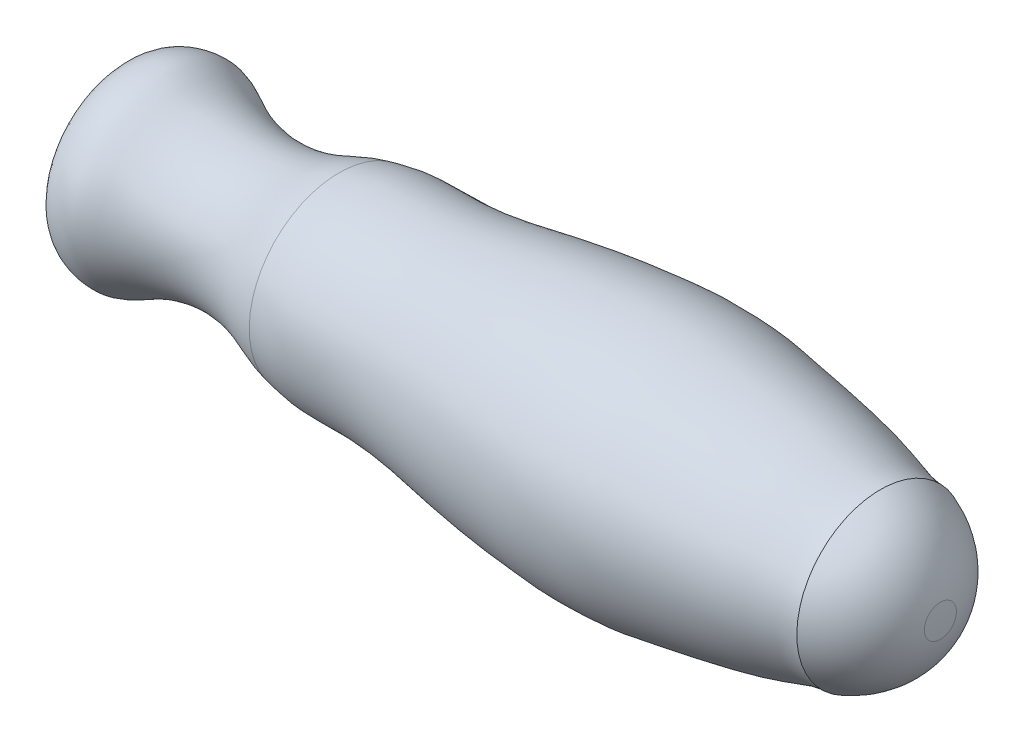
from build123d import *


with BuildPart() as part:
    # Esquisse1 → R_volution2 (revolve)
    with BuildSketch(Plane.XY):
        with BuildLine():
            Line((0, 0), (0, -3.401426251))
            add(Edge.make_bspline(
                [(0, -3.401426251), (-0.155626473, -7.164391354), (0.545364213, -10.877495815)],
                knots=[0, 0, 0, 1, 1, 1], degree=2))
            add(Edge.make_bspline(
                [(0.545364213, -10.877495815), (1.370348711, -11.974386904), (3.322599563, -12.830240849), (6.1946299, -12.924419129), (8.217292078, -11.885870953), (10.513673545, -10.674466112), (13.281514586, -9.808697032), (16.63195169, -9.223476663), (20.26291873, -9.325960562), (24.156837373, -10.163375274), (27.190596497, -11.558728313), (29.163277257, -12.059936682), (29.777909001, -12.206134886)],
                knots=[0, 0, 0, 0, 0.120356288, 0.182103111, 0.252493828, 0.320379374, 0.416926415, 0.511670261, 0.625759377, 0.741661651, 0.867963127, 0.924773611, 0.924773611, 0.924773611, 0.924773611], degree=3))
            add(Edge.make_bspline(
                [(29.777909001, -12.206134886), (31.13461791, -12.450353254), (33.16756523, -12.891149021), (36.387648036, -12.905092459), (39.171536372, -12.879877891), (42.625903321, -12.979104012), (46.218046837, -13.346962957), (49.916730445, -14.006778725), (53.621808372, -14.640491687), (57.266189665, -15.174429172), (61.120160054, -15.681235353), (65.140508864, -15.997601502), (69.272038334, -16.421387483), (73.606560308, -16.352122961), (77.783899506, -16.21619251), (81.990209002, -15.531584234), (86.314059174, -14.803957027), (91.847427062, -13.851504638), (97.750889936, -12.539019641), (101.929439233, -10.960357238), (103.818425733, -10.988192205)],
                knots=[0, 0, 0, 0, 0.055398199, 0.08267741, 0.128818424, 0.167035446, 0.221096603, 0.273333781, 0.317568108, 0.371733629, 0.42094103, 0.473294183, 0.533363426, 0.587167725, 0.646878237, 0.700631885, 0.757710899, 0.822668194, 0.925588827, 1, 1, 1, 1], degree=3))
            add(Edge.make_bspline(
                [(103.818425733, -10.988192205), (105.386632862, -10.395573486), (109.210159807, -8.226972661), (111.462986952, -4.230800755), (111.92227912, -1.652205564)],
                knots=[0, 0, 0, 0, 0.390825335, 1, 1, 1, 1], degree=3))
            add(Edge.make_bspline(
                [(112, 0.541102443), (112.005297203, -0.555338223), (111.92227912, -1.652205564)],
                knots=[0.5, 0.5, 0.5, 1, 1, 1], degree=2))
            Line((112, 0.541102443), (0, 0))
        make_face()
    revolve(axis=Axis((0, 0, 0), (0.9999883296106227, 0.0048312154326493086, 0)))


solid = part.part
